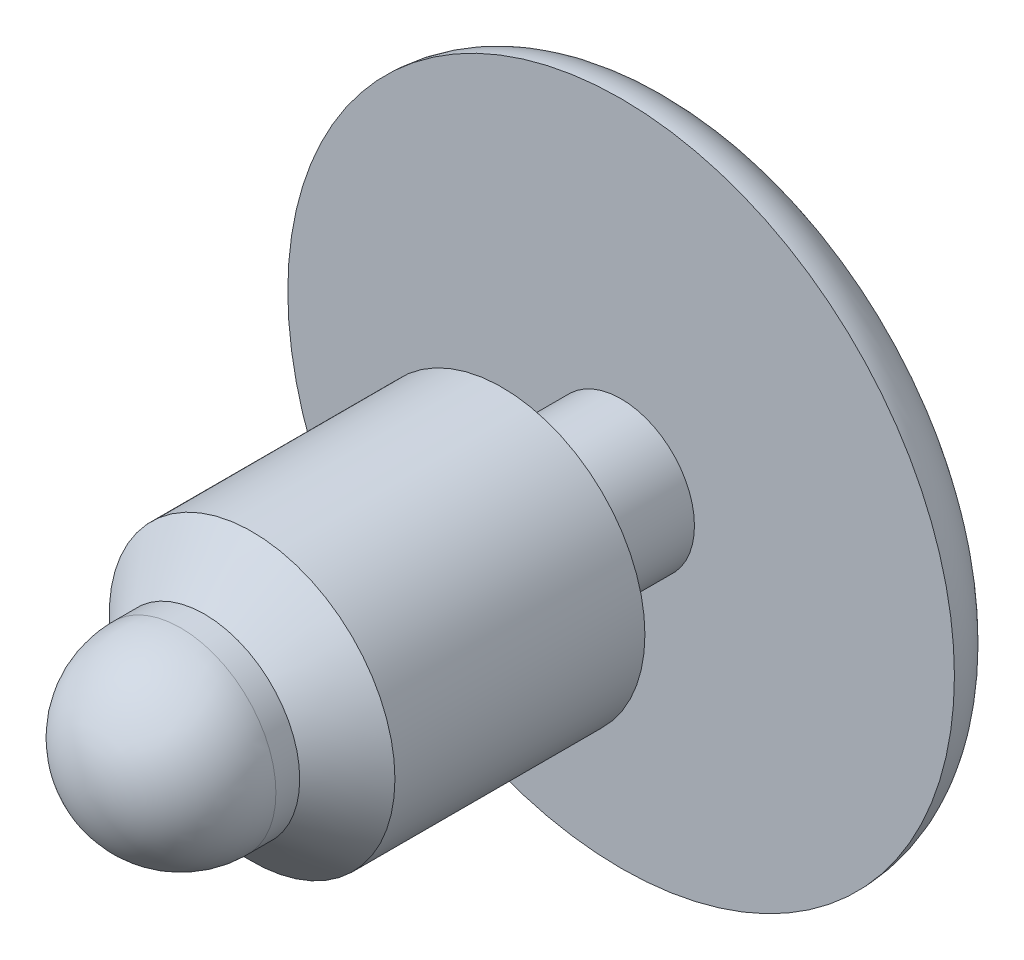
ISO-10303-21;
HEADER;
FILE_DESCRIPTION(('STEP AP214'),'2;1');
FILE_NAME('part.step','',(''),(''),'','','');
FILE_SCHEMA(('AUTOMOTIVE_DESIGN { 1 0 10303 214 1 1 1 1 }'));
ENDSEC;
DATA;
#1=APPLICATION_CONTEXT('core data for automotive mechanical design processes');
#2=APPLICATION_PROTOCOL_DEFINITION('international standard','automotive_design',2000,#1);
#3=PRODUCT_CONTEXT('',#1,'mechanical');
#4=PRODUCT('Part','Part','',(#3));
#5=PRODUCT_RELATED_PRODUCT_CATEGORY('part','',(#4));
#6=PRODUCT_DEFINITION_FORMATION('','',#4);
#7=PRODUCT_DEFINITION_CONTEXT('part definition',#1,'design');
#8=PRODUCT_DEFINITION('design','',#6,#7);
#9=PRODUCT_DEFINITION_SHAPE('','',#8);
#10=(LENGTH_UNIT() NAMED_UNIT(*) SI_UNIT(.MILLI.,.METRE.));
#11=(NAMED_UNIT(*) PLANE_ANGLE_UNIT() SI_UNIT($,.RADIAN.));
#12=(NAMED_UNIT(*) SI_UNIT($,.STERADIAN.) SOLID_ANGLE_UNIT());
#13=UNCERTAINTY_MEASURE_WITH_UNIT(LENGTH_MEASURE(1.E-05),#10,'distance_accuracy_value','');
#14=(GEOMETRIC_REPRESENTATION_CONTEXT(3) GLOBAL_UNCERTAINTY_ASSIGNED_CONTEXT((#13)) GLOBAL_UNIT_ASSIGNED_CONTEXT((#10,
#11,#12)) REPRESENTATION_CONTEXT('',''));
#15=CARTESIAN_POINT('',(0.,0.,0.));
#16=DIRECTION('',(0.,0.,1.));
#17=DIRECTION('',(1.,0.,0.));
#18=AXIS2_PLACEMENT_3D('',#15,#16,#17);
#19=CARTESIAN_POINT('',(0.,0.,1.524));
#20=DIRECTION('',(0.,0.,1.));
#21=DIRECTION('',(1.,0.,0.));
#22=AXIS2_PLACEMENT_3D('',#19,#20,#21);
#23=PLANE('',#22);
#24=CARTESIAN_POINT('',(0.,0.,1.524));
#25=DIRECTION('',(0.,0.,1.));
#26=DIRECTION('',(1.,0.,0.));
#27=AXIS2_PLACEMENT_3D('',#24,#25,#26);
#28=CIRCLE('',#27,8.89);
#29=CARTESIAN_POINT('',(8.89,0.,1.524));
#30=VERTEX_POINT('',#29);
#31=EDGE_CURVE('E43',#30,#30,#28,.T.);
#32=ORIENTED_EDGE('',*,*,#31,.T.);
#33=EDGE_LOOP('',(#32));
#34=FACE_BOUND('',#33,.T.);
#35=CARTESIAN_POINT('',(0.,0.,1.524));
#36=DIRECTION('',(0.,0.,1.));
#37=DIRECTION('',(1.,0.,0.));
#38=AXIS2_PLACEMENT_3D('',#35,#36,#37);
#39=CIRCLE('',#38,1.9558);
#40=CARTESIAN_POINT('',(1.9558,0.,1.524));
#41=VERTEX_POINT('',#40);
#42=EDGE_CURVE('E51',#41,#41,#39,.T.);
#43=ORIENTED_EDGE('',*,*,#42,.F.);
#44=EDGE_LOOP('',(#43));
#45=FACE_BOUND('',#44,.T.);
#46=ADVANCED_FACE('F29',(#34,#45),#23,.T.);
#47=CARTESIAN_POINT('',(0.,0.,0.));
#48=DIRECTION('',(0.,0.,1.));
#49=DIRECTION('',(1.,0.,0.));
#50=AXIS2_PLACEMENT_3D('',#47,#48,#49);
#51=PLANE('',#50);
#52=CARTESIAN_POINT('',(0.,0.,0.));
#53=DIRECTION('',(0.,0.,1.));
#54=DIRECTION('',(1.,0.,0.));
#55=AXIS2_PLACEMENT_3D('',#52,#53,#54);
#56=CIRCLE('',#55,7.366);
#57=CARTESIAN_POINT('',(7.366,0.,0.));
#58=VERTEX_POINT('',#57);
#59=EDGE_CURVE('E10',#58,#58,#56,.F.);
#60=ORIENTED_EDGE('',*,*,#59,.T.);
#61=EDGE_LOOP('',(#60));
#62=FACE_BOUND('',#61,.T.);
#63=ADVANCED_FACE('F78',(#62),#51,.F.);
#64=CARTESIAN_POINT('',(0.,0.,4.699));
#65=DIRECTION('',(0.,0.,-1.));
#66=DIRECTION('',(-1.,0.,0.));
#67=AXIS2_PLACEMENT_3D('',#64,#65,#66);
#68=CYLINDRICAL_SURFACE('',#67,1.9558);
#69=CARTESIAN_POINT('',(0.,0.,4.699));
#70=DIRECTION('',(0.,0.,1.));
#71=DIRECTION('',(1.,0.,0.));
#72=AXIS2_PLACEMENT_3D('',#69,#70,#71);
#73=CIRCLE('',#72,1.9558);
#74=CARTESIAN_POINT('',(1.9558,0.,4.699));
#75=VERTEX_POINT('',#74);
#76=EDGE_CURVE('E48',#75,#75,#73,.T.);
#77=ORIENTED_EDGE('',*,*,#76,.F.);
#78=EDGE_LOOP('',(#77));
#79=FACE_BOUND('',#78,.T.);
#80=ORIENTED_EDGE('',*,*,#42,.T.);
#81=EDGE_LOOP('',(#80));
#82=FACE_BOUND('',#81,.T.);
#83=ADVANCED_FACE('F83',(#79,#82),#68,.T.);
#84=CARTESIAN_POINT('',(0.,0.,4.699));
#85=DIRECTION('',(0.,0.,1.));
#86=DIRECTION('',(1.,0.,0.));
#87=AXIS2_PLACEMENT_3D('',#84,#85,#86);
#88=PLANE('',#87);
#89=CARTESIAN_POINT('',(0.,0.,4.699));
#90=DIRECTION('',(0.,0.,1.));
#91=DIRECTION('',(1.,0.,0.));
#92=AXIS2_PLACEMENT_3D('',#89,#90,#91);
#93=CIRCLE('',#92,3.81);
#94=CARTESIAN_POINT('',(3.81,0.,4.699));
#95=VERTEX_POINT('',#94);
#96=EDGE_CURVE('E54',#95,#95,#93,.T.);
#97=ORIENTED_EDGE('',*,*,#96,.F.);
#98=EDGE_LOOP('',(#97));
#99=FACE_BOUND('',#98,.T.);
#100=ORIENTED_EDGE('',*,*,#76,.T.);
#101=EDGE_LOOP('',(#100));
#102=FACE_BOUND('',#101,.T.);
#103=ADVANCED_FACE('F89',(#99,#102),#88,.F.);
#104=CARTESIAN_POINT('',(0.,0.,12.6365));
#105=DIRECTION('',(0.,0.,-1.));
#106=DIRECTION('',(-1.,0.,0.));
#107=AXIS2_PLACEMENT_3D('',#104,#105,#106);
#108=CYLINDRICAL_SURFACE('',#107,3.81);
#109=CARTESIAN_POINT('',(0.,0.,11.3665));
#110=DIRECTION('',(0.,0.,1.));
#111=DIRECTION('',(1.,0.,0.));
#112=AXIS2_PLACEMENT_3D('',#109,#110,#111);
#113=CIRCLE('',#112,3.81);
#114=CARTESIAN_POINT('',(3.81,0.,11.3665));
#115=VERTEX_POINT('',#114);
#116=EDGE_CURVE('E35',#115,#115,#113,.F.);
#117=ORIENTED_EDGE('',*,*,#116,.T.);
#118=EDGE_LOOP('',(#117));
#119=FACE_BOUND('',#118,.T.);
#120=ORIENTED_EDGE('',*,*,#96,.T.);
#121=EDGE_LOOP('',(#120));
#122=FACE_BOUND('',#121,.T.);
#123=ADVANCED_FACE('F95',(#119,#122),#108,.T.);
#124=CARTESIAN_POINT('',(0.,0.,15.8115));
#125=DIRECTION('',(0.,0.,-1.));
#126=DIRECTION('',(-1.,0.,0.));
#127=AXIS2_PLACEMENT_3D('',#124,#125,#126);
#128=CYLINDRICAL_SURFACE('',#127,2.54);
#129=CARTESIAN_POINT('',(0.,0.,13.2715));
#130=DIRECTION('',(0.,0.,-1.));
#131=DIRECTION('',(-1.,0.,0.));
#132=AXIS2_PLACEMENT_3D('',#129,#130,#131);
#133=CIRCLE('',#132,2.54);
#134=CARTESIAN_POINT('',(-2.54,0.,13.2715));
#135=VERTEX_POINT('',#134);
#136=EDGE_CURVE('E39',#135,#135,#133,.T.);
#137=ORIENTED_EDGE('',*,*,#136,.T.);
#138=EDGE_LOOP('',(#137));
#139=FACE_BOUND('',#138,.T.);
#140=CARTESIAN_POINT('',(0.,0.,12.6365));
#141=DIRECTION('',(0.,0.,1.));
#142=DIRECTION('',(1.,0.,0.));
#143=AXIS2_PLACEMENT_3D('',#140,#141,#142);
#144=CIRCLE('',#143,2.54);
#145=CARTESIAN_POINT('',(2.54,0.,12.6365));
#146=VERTEX_POINT('',#145);
#147=EDGE_CURVE('E57',#146,#146,#144,.T.);
#148=ORIENTED_EDGE('',*,*,#147,.T.);
#149=EDGE_LOOP('',(#148));
#150=FACE_BOUND('',#149,.T.);
#151=ADVANCED_FACE('F61',(#139,#150),#128,.T.);
#152=CARTESIAN_POINT('',(0.,0.,13.2715));
#153=DIRECTION('',(0.,0.,1.));
#154=DIRECTION('',(1.,0.,0.));
#155=AXIS2_PLACEMENT_3D('',#152,#153,#154);
#156=SPHERICAL_SURFACE('',#155,2.54);
#157=ORIENTED_EDGE('',*,*,#136,.F.);
#158=EDGE_LOOP('',(#157));
#159=FACE_BOUND('',#158,.T.);
#160=ADVANCED_FACE('F66',(#159),#156,.T.);
#161=CARTESIAN_POINT('',(0.,0.,12.6365));
#162=DIRECTION('',(0.,0.,-1.));
#163=DIRECTION('',(-1.,0.,0.));
#164=AXIS2_PLACEMENT_3D('',#161,#162,#163);
#165=CONICAL_SURFACE('',#164,2.54,0.785398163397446);
#166=ORIENTED_EDGE('',*,*,#116,.F.);
#167=EDGE_LOOP('',(#166));
#168=FACE_BOUND('',#167,.T.);
#169=ORIENTED_EDGE('',*,*,#147,.F.);
#170=EDGE_LOOP('',(#169));
#171=FACE_BOUND('',#170,.T.);
#172=ADVANCED_FACE('F63',(#168,#171),#165,.T.);
#173=CARTESIAN_POINT('',(0.,0.,1.524));
#174=DIRECTION('',(0.,0.,1.));
#175=DIRECTION('',(1.,0.,0.));
#176=AXIS2_PLACEMENT_3D('',#173,#174,#175);
#177=TOROIDAL_SURFACE('',#176,7.366,1.524);
#178=ORIENTED_EDGE('',*,*,#59,.F.);
#179=EDGE_LOOP('',(#178));
#180=FACE_BOUND('',#179,.T.);
#181=ORIENTED_EDGE('',*,*,#31,.F.);
#182=EDGE_LOOP('',(#181));
#183=FACE_BOUND('',#182,.T.);
#184=ADVANCED_FACE('F65',(#180,#183),#177,.T.);
#185=CLOSED_SHELL('',(#46,#63,#83,#103,#123,#151,#160,#172,#184));
#186=MANIFOLD_SOLID_BREP('B2',#185);
#187=ADVANCED_BREP_SHAPE_REPRESENTATION('',(#18,#186),#14);
#188=SHAPE_DEFINITION_REPRESENTATION(#9,#187);
ENDSEC;
END-ISO-10303-21;
